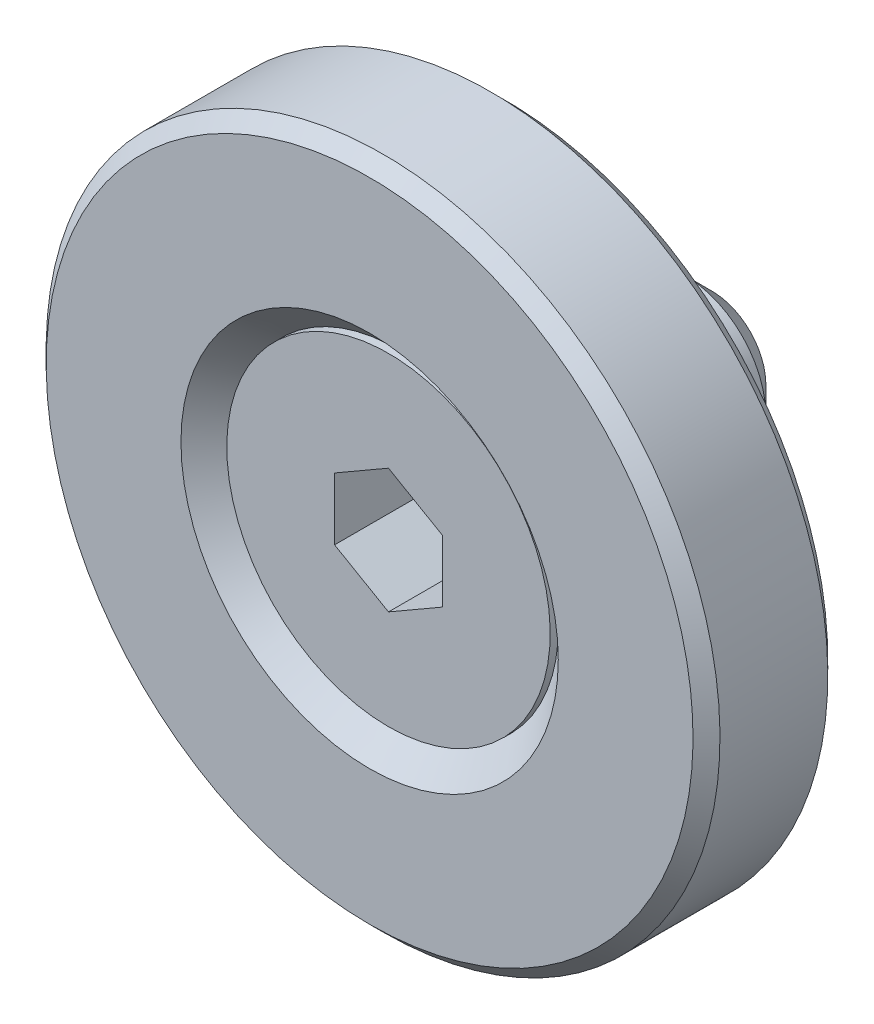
ISO-10303-21;
HEADER;
FILE_DESCRIPTION(('STEP AP214'),'2;1');
FILE_NAME('part.step','',(''),(''),'','','');
FILE_SCHEMA(('AUTOMOTIVE_DESIGN { 1 0 10303 214 1 1 1 1 }'));
ENDSEC;
DATA;
#1=APPLICATION_CONTEXT('core data for automotive mechanical design processes');
#2=APPLICATION_PROTOCOL_DEFINITION('international standard','automotive_design',2000,#1);
#3=PRODUCT_CONTEXT('',#1,'mechanical');
#4=PRODUCT('Part','Part','',(#3));
#5=PRODUCT_RELATED_PRODUCT_CATEGORY('part','',(#4));
#6=PRODUCT_DEFINITION_FORMATION('','',#4);
#7=PRODUCT_DEFINITION_CONTEXT('part definition',#1,'design');
#8=PRODUCT_DEFINITION('design','',#6,#7);
#9=PRODUCT_DEFINITION_SHAPE('','',#8);
#10=(LENGTH_UNIT() NAMED_UNIT(*) SI_UNIT(.MILLI.,.METRE.));
#11=(NAMED_UNIT(*) PLANE_ANGLE_UNIT() SI_UNIT($,.RADIAN.));
#12=(NAMED_UNIT(*) SI_UNIT($,.STERADIAN.) SOLID_ANGLE_UNIT());
#13=UNCERTAINTY_MEASURE_WITH_UNIT(LENGTH_MEASURE(1.E-05),#10,'distance_accuracy_value','');
#14=(GEOMETRIC_REPRESENTATION_CONTEXT(3) GLOBAL_UNCERTAINTY_ASSIGNED_CONTEXT((#13)) GLOBAL_UNIT_ASSIGNED_CONTEXT((#10,
#11,#12)) REPRESENTATION_CONTEXT('',''));
#15=CARTESIAN_POINT('',(0.,0.,0.));
#16=DIRECTION('',(0.,0.,1.));
#17=DIRECTION('',(1.,0.,0.));
#18=AXIS2_PLACEMENT_3D('',#15,#16,#17);
#19=CARTESIAN_POINT('',(0.,0.,10.));
#20=DIRECTION('',(0.,0.,1.));
#21=DIRECTION('',(0.,-1.,0.));
#22=AXIS2_PLACEMENT_3D('',#19,#20,#21);
#23=CYLINDRICAL_SURFACE('',#22,3.00000000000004);
#24=CARTESIAN_POINT('',(0.,0.,1.00000000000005));
#25=DIRECTION('',(0.,0.,1.));
#26=DIRECTION('',(0.,-1.,0.));
#27=AXIS2_PLACEMENT_3D('',#24,#25,#26);
#28=CIRCLE('',#27,3.);
#29=CARTESIAN_POINT('',(0.,-2.99999999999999,1.00000000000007));
#30=VERTEX_POINT('',#29);
#31=EDGE_CURVE('E115',#30,#30,#28,.T.);
#32=ORIENTED_EDGE('',*,*,#31,.F.);
#33=EDGE_LOOP('',(#32));
#34=FACE_BOUND('',#33,.T.);
#35=CARTESIAN_POINT('',(0.,0.,-6.7));
#36=DIRECTION('',(0.,0.,1.));
#37=DIRECTION('',(0.,-1.,0.));
#38=AXIS2_PLACEMENT_3D('',#35,#36,#37);
#39=CIRCLE('',#38,3.00000000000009);
#40=CARTESIAN_POINT('',(0.,-3.00000000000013,-6.69999999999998));
#41=VERTEX_POINT('',#40);
#42=EDGE_CURVE('E9',#41,#41,#39,.T.);
#43=ORIENTED_EDGE('',*,*,#42,.T.);
#44=EDGE_LOOP('',(#43));
#45=FACE_BOUND('',#44,.T.);
#46=ADVANCED_FACE('F14',(#34,#45),#23,.T.);
#47=CARTESIAN_POINT('',(0.,0.,-7.7));
#48=DIRECTION('',(0.,0.,1.));
#49=DIRECTION('',(0.,-1.,0.));
#50=AXIS2_PLACEMENT_3D('',#47,#48,#49);
#51=CONICAL_SURFACE('',#50,2.0000000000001,0.785398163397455);
#52=ORIENTED_EDGE('',*,*,#42,.F.);
#53=EDGE_LOOP('',(#52));
#54=FACE_BOUND('',#53,.T.);
#55=CARTESIAN_POINT('',(0.,0.,-7.7));
#56=DIRECTION('',(0.,0.,1.));
#57=DIRECTION('',(0.,-1.,0.));
#58=AXIS2_PLACEMENT_3D('',#55,#56,#57);
#59=CIRCLE('',#58,2.0000000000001);
#60=CARTESIAN_POINT('',(0.,-2.00000000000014,-7.69999999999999));
#61=VERTEX_POINT('',#60);
#62=EDGE_CURVE('E21',#61,#61,#59,.T.);
#63=ORIENTED_EDGE('',*,*,#62,.T.);
#64=EDGE_LOOP('',(#63));
#65=FACE_BOUND('',#64,.T.);
#66=ADVANCED_FACE('F155',(#54,#65),#51,.T.);
#67=CARTESIAN_POINT('',(0.,2.00000000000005,-7.7));
#68=DIRECTION('',(0.,0.,1.));
#69=DIRECTION('',(0.,-1.,0.));
#70=AXIS2_PLACEMENT_3D('',#67,#68,#69);
#71=PLANE('',#70);
#72=ORIENTED_EDGE('',*,*,#62,.F.);
#73=EDGE_LOOP('',(#72));
#74=FACE_BOUND('',#73,.T.);
#75=ADVANCED_FACE('F157',(#74),#71,.F.);
#76=CARTESIAN_POINT('',(0.,0.,4.30000000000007));
#77=DIRECTION('',(0.,0.,-1.));
#78=DIRECTION('',(0.,1.,0.));
#79=AXIS2_PLACEMENT_3D('',#76,#77,#78);
#80=PLANE('',#79);
#81=DIRECTION('',(-0.866025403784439,-0.5,0.));
#82=VECTOR('',#81,1.);
#83=CARTESIAN_POINT('',(0.,2.30940107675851,4.30000000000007));
#84=LINE('',#83,#82);
#85=CARTESIAN_POINT('',(0.,2.30940107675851,4.30000000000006));
#86=VERTEX_POINT('',#85);
#87=CARTESIAN_POINT('',(-2.,1.15470053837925,4.30000000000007));
#88=VERTEX_POINT('',#87);
#89=EDGE_CURVE('E102',#86,#88,#84,.T.);
#90=ORIENTED_EDGE('',*,*,#89,.F.);
#91=DIRECTION('',(-0.866025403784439,0.5,0.));
#92=VECTOR('',#91,1.);
#93=CARTESIAN_POINT('',(2.,1.15470053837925,4.30000000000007));
#94=LINE('',#93,#92);
#95=CARTESIAN_POINT('',(2.,1.15470053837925,4.30000000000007));
#96=VERTEX_POINT('',#95);
#97=EDGE_CURVE('E28',#96,#86,#94,.T.);
#98=ORIENTED_EDGE('',*,*,#97,.F.);
#99=DIRECTION('',(0.,1.,0.));
#100=VECTOR('',#99,1.);
#101=CARTESIAN_POINT('',(2.,-1.15470053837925,4.30000000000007));
#102=LINE('',#101,#100);
#103=CARTESIAN_POINT('',(2.,-1.15470053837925,4.30000000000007));
#104=VERTEX_POINT('',#103);
#105=EDGE_CURVE('E111',#104,#96,#102,.T.);
#106=ORIENTED_EDGE('',*,*,#105,.F.);
#107=DIRECTION('',(0.866025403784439,0.5,0.));
#108=VECTOR('',#107,1.);
#109=CARTESIAN_POINT('',(0.,-2.30940107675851,4.30000000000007));
#110=LINE('',#109,#108);
#111=CARTESIAN_POINT('',(0.,-2.30940107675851,4.30000000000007));
#112=VERTEX_POINT('',#111);
#113=EDGE_CURVE('E109',#112,#104,#110,.T.);
#114=ORIENTED_EDGE('',*,*,#113,.F.);
#115=DIRECTION('',(0.866025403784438,-0.5,0.));
#116=VECTOR('',#115,1.);
#117=CARTESIAN_POINT('',(-2.,-1.15470053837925,4.30000000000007));
#118=LINE('',#117,#116);
#119=CARTESIAN_POINT('',(-2.,-1.15470053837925,4.30000000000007));
#120=VERTEX_POINT('',#119);
#121=EDGE_CURVE('E76',#120,#112,#118,.T.);
#122=ORIENTED_EDGE('',*,*,#121,.F.);
#123=DIRECTION('',(0.,-1.,0.));
#124=VECTOR('',#123,1.);
#125=CARTESIAN_POINT('',(-2.,1.15470053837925,4.30000000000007));
#126=LINE('',#125,#124);
#127=EDGE_CURVE('E105',#88,#120,#126,.T.);
#128=ORIENTED_EDGE('',*,*,#127,.F.);
#129=EDGE_LOOP('',(#90,#98,#106,#114,#122,#128));
#130=FACE_BOUND('',#129,.T.);
#131=CARTESIAN_POINT('',(0.,0.,4.3000000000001));
#132=DIRECTION('',(0.,0.,1.));
#133=DIRECTION('',(0.,-1.,0.));
#134=AXIS2_PLACEMENT_3D('',#131,#132,#133);
#135=CIRCLE('',#134,6.);
#136=CARTESIAN_POINT('',(0.,-5.99999999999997,4.30000000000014));
#137=VERTEX_POINT('',#136);
#138=EDGE_CURVE('E150',#137,#137,#135,.T.);
#139=ORIENTED_EDGE('',*,*,#138,.T.);
#140=EDGE_LOOP('',(#139));
#141=FACE_BOUND('',#140,.T.);
#142=ADVANCED_FACE('F159',(#130,#141),#80,.F.);
#143=CARTESIAN_POINT('',(0.,0.,10.));
#144=DIRECTION('',(0.,0.,1.));
#145=DIRECTION('',(0.,-1.,0.));
#146=AXIS2_PLACEMENT_3D('',#143,#144,#145);
#147=CYLINDRICAL_SURFACE('',#146,6.);
#148=ORIENTED_EDGE('',*,*,#138,.F.);
#149=EDGE_LOOP('',(#148));
#150=FACE_BOUND('',#149,.T.);
#151=CARTESIAN_POINT('',(0.,0.,4.00000000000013));
#152=DIRECTION('',(0.,0.,1.));
#153=DIRECTION('',(0.,-1.,0.));
#154=AXIS2_PLACEMENT_3D('',#151,#152,#153);
#155=CIRCLE('',#154,6.);
#156=CARTESIAN_POINT('',(0.,-5.99999999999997,4.00000000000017));
#157=VERTEX_POINT('',#156);
#158=EDGE_CURVE('E147',#157,#157,#155,.T.);
#159=ORIENTED_EDGE('',*,*,#158,.T.);
#160=EDGE_LOOP('',(#159));
#161=FACE_BOUND('',#160,.T.);
#162=ADVANCED_FACE('F166',(#150,#161),#147,.T.);
#163=CARTESIAN_POINT('',(0.,0.,5.));
#164=DIRECTION('',(0.,0.,1.));
#165=DIRECTION('',(0.,-1.,0.));
#166=AXIS2_PLACEMENT_3D('',#163,#164,#165);
#167=CONICAL_SURFACE('',#166,7.,0.785398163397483);
#168=ORIENTED_EDGE('',*,*,#158,.F.);
#169=EDGE_LOOP('',(#168));
#170=FACE_BOUND('',#169,.T.);
#171=CARTESIAN_POINT('',(0.,0.,5.));
#172=DIRECTION('',(0.,0.,1.));
#173=DIRECTION('',(0.,-1.,0.));
#174=AXIS2_PLACEMENT_3D('',#171,#172,#173);
#175=CIRCLE('',#174,7.);
#176=CARTESIAN_POINT('',(0.,-6.99999999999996,5.00000000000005));
#177=VERTEX_POINT('',#176);
#178=EDGE_CURVE('E144',#177,#177,#175,.T.);
#179=ORIENTED_EDGE('',*,*,#178,.T.);
#180=EDGE_LOOP('',(#179));
#181=FACE_BOUND('',#180,.T.);
#182=ADVANCED_FACE('F218',(#170,#181),#167,.F.);
#183=CARTESIAN_POINT('',(0.,12.,5.));
#184=DIRECTION('',(0.,0.,-1.));
#185=DIRECTION('',(0.,1.,0.));
#186=AXIS2_PLACEMENT_3D('',#183,#184,#185);
#187=PLANE('',#186);
#188=ORIENTED_EDGE('',*,*,#178,.F.);
#189=EDGE_LOOP('',(#188));
#190=FACE_BOUND('',#189,.T.);
#191=CARTESIAN_POINT('',(0.,0.,5.00000000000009));
#192=DIRECTION('',(0.,0.,1.));
#193=DIRECTION('',(0.,-1.,0.));
#194=AXIS2_PLACEMENT_3D('',#191,#192,#193);
#195=CIRCLE('',#194,12.);
#196=CARTESIAN_POINT('',(0.,-12.,5.00000000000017));
#197=VERTEX_POINT('',#196);
#198=EDGE_CURVE('E141',#197,#197,#195,.T.);
#199=ORIENTED_EDGE('',*,*,#198,.T.);
#200=EDGE_LOOP('',(#199));
#201=FACE_BOUND('',#200,.T.);
#202=ADVANCED_FACE('F214',(#190,#201),#187,.F.);
#203=CARTESIAN_POINT('',(0.,0.,4.50000000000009));
#204=DIRECTION('',(0.,0.,-1.));
#205=DIRECTION('',(0.,1.,0.));
#206=AXIS2_PLACEMENT_3D('',#203,#204,#205);
#207=CONICAL_SURFACE('',#206,12.5,0.785398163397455);
#208=ORIENTED_EDGE('',*,*,#198,.F.);
#209=EDGE_LOOP('',(#208));
#210=FACE_BOUND('',#209,.T.);
#211=CARTESIAN_POINT('',(0.,0.,4.50000000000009));
#212=DIRECTION('',(0.,0.,1.));
#213=DIRECTION('',(0.,-1.,0.));
#214=AXIS2_PLACEMENT_3D('',#211,#212,#213);
#215=CIRCLE('',#214,12.5);
#216=CARTESIAN_POINT('',(0.,-12.5,4.50000000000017));
#217=VERTEX_POINT('',#216);
#218=EDGE_CURVE('E138',#217,#217,#215,.T.);
#219=ORIENTED_EDGE('',*,*,#218,.T.);
#220=EDGE_LOOP('',(#219));
#221=FACE_BOUND('',#220,.T.);
#222=ADVANCED_FACE('F210',(#210,#221),#207,.T.);
#223=CARTESIAN_POINT('',(0.,0.,10.));
#224=DIRECTION('',(0.,0.,1.));
#225=DIRECTION('',(0.,-1.,0.));
#226=AXIS2_PLACEMENT_3D('',#223,#224,#225);
#227=CYLINDRICAL_SURFACE('',#226,12.5);
#228=ORIENTED_EDGE('',*,*,#218,.F.);
#229=EDGE_LOOP('',(#228));
#230=FACE_BOUND('',#229,.T.);
#231=CARTESIAN_POINT('',(0.,0.,0.500000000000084));
#232=DIRECTION('',(0.,0.,1.));
#233=DIRECTION('',(0.,-1.,0.));
#234=AXIS2_PLACEMENT_3D('',#231,#232,#233);
#235=CIRCLE('',#234,12.5);
#236=CARTESIAN_POINT('',(0.,-12.5,0.500000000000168));
#237=VERTEX_POINT('',#236);
#238=EDGE_CURVE('E135',#237,#237,#235,.T.);
#239=ORIENTED_EDGE('',*,*,#238,.T.);
#240=EDGE_LOOP('',(#239));
#241=FACE_BOUND('',#240,.T.);
#242=ADVANCED_FACE('F206',(#230,#241),#227,.T.);
#243=CARTESIAN_POINT('',(0.,0.,0.));
#244=DIRECTION('',(0.,0.,1.));
#245=DIRECTION('',(0.,-1.,0.));
#246=AXIS2_PLACEMENT_3D('',#243,#244,#245);
#247=CONICAL_SURFACE('',#246,12.,0.785398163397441);
#248=ORIENTED_EDGE('',*,*,#238,.F.);
#249=EDGE_LOOP('',(#248));
#250=FACE_BOUND('',#249,.T.);
#251=CARTESIAN_POINT('',(0.,0.,0.));
#252=DIRECTION('',(0.,0.,1.));
#253=DIRECTION('',(0.,-1.,0.));
#254=AXIS2_PLACEMENT_3D('',#251,#252,#253);
#255=CIRCLE('',#254,12.);
#256=CARTESIAN_POINT('',(0.,-12.,1.60142367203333E-13));
#257=VERTEX_POINT('',#256);
#258=EDGE_CURVE('E132',#257,#257,#255,.T.);
#259=ORIENTED_EDGE('',*,*,#258,.T.);
#260=EDGE_LOOP('',(#259));
#261=FACE_BOUND('',#260,.T.);
#262=ADVANCED_FACE('F202',(#250,#261),#247,.T.);
#263=CARTESIAN_POINT('',(0.,3.40000000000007,0.));
#264=DIRECTION('',(0.,0.,1.));
#265=DIRECTION('',(0.,-1.,0.));
#266=AXIS2_PLACEMENT_3D('',#263,#264,#265);
#267=PLANE('',#266);
#268=ORIENTED_EDGE('',*,*,#258,.F.);
#269=EDGE_LOOP('',(#268));
#270=FACE_BOUND('',#269,.T.);
#271=CARTESIAN_POINT('',(0.,0.,0.));
#272=DIRECTION('',(0.,0.,1.));
#273=DIRECTION('',(0.,-1.,0.));
#274=AXIS2_PLACEMENT_3D('',#271,#272,#273);
#275=CIRCLE('',#274,3.40000000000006);
#276=CARTESIAN_POINT('',(0.,-3.40000000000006,0.));
#277=VERTEX_POINT('',#276);
#278=EDGE_CURVE('E129',#277,#277,#275,.T.);
#279=ORIENTED_EDGE('',*,*,#278,.T.);
#280=EDGE_LOOP('',(#279));
#281=FACE_BOUND('',#280,.T.);
#282=ADVANCED_FACE('F198',(#270,#281),#267,.F.);
#283=CARTESIAN_POINT('',(0.,0.,0.200000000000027));
#284=DIRECTION('',(0.,0.,-1.));
#285=DIRECTION('',(0.,1.,0.));
#286=AXIS2_PLACEMENT_3D('',#283,#284,#285);
#287=CONICAL_SURFACE('',#286,3.20000000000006,0.785398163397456);
#288=ORIENTED_EDGE('',*,*,#278,.F.);
#289=EDGE_LOOP('',(#288));
#290=FACE_BOUND('',#289,.T.);
#291=CARTESIAN_POINT('',(0.,0.,0.200000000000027));
#292=DIRECTION('',(0.,0.,1.));
#293=DIRECTION('',(0.,-1.,0.));
#294=AXIS2_PLACEMENT_3D('',#291,#292,#293);
#295=CIRCLE('',#294,3.20000000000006);
#296=CARTESIAN_POINT('',(0.,-3.20000000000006,0.200000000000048));
#297=VERTEX_POINT('',#296);
#298=EDGE_CURVE('E126',#297,#297,#295,.T.);
#299=ORIENTED_EDGE('',*,*,#298,.T.);
#300=EDGE_LOOP('',(#299));
#301=FACE_BOUND('',#300,.T.);
#302=ADVANCED_FACE('F190',(#290,#301),#287,.F.);
#303=CARTESIAN_POINT('',(0.,0.,10.));
#304=DIRECTION('',(0.,0.,1.));
#305=DIRECTION('',(0.,-1.,0.));
#306=AXIS2_PLACEMENT_3D('',#303,#304,#305);
#307=CYLINDRICAL_SURFACE('',#306,3.20000000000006);
#308=ORIENTED_EDGE('',*,*,#298,.F.);
#309=EDGE_LOOP('',(#308));
#310=FACE_BOUND('',#309,.T.);
#311=CARTESIAN_POINT('',(0.,0.,1.20000000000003));
#312=DIRECTION('',(0.,0.,1.));
#313=DIRECTION('',(0.,-1.,0.));
#314=AXIS2_PLACEMENT_3D('',#311,#312,#313);
#315=CIRCLE('',#314,3.20000000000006);
#316=CARTESIAN_POINT('',(0.,-3.20000000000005,1.20000000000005));
#317=VERTEX_POINT('',#316);
#318=EDGE_CURVE('E123',#317,#317,#315,.T.);
#319=ORIENTED_EDGE('',*,*,#318,.T.);
#320=EDGE_LOOP('',(#319));
#321=FACE_BOUND('',#320,.T.);
#322=ADVANCED_FACE('F181',(#310,#321),#307,.F.);
#323=CARTESIAN_POINT('',(0.,0.,1.00000000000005));
#324=DIRECTION('',(0.,0.,1.));
#325=DIRECTION('',(0.,-1.,0.));
#326=AXIS2_PLACEMENT_3D('',#323,#324,#325);
#327=CONICAL_SURFACE('',#326,3.,0.785398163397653);
#328=ORIENTED_EDGE('',*,*,#318,.F.);
#329=EDGE_LOOP('',(#328));
#330=FACE_BOUND('',#329,.T.);
#331=ORIENTED_EDGE('',*,*,#31,.T.);
#332=EDGE_LOOP('',(#331));
#333=FACE_BOUND('',#332,.T.);
#334=ADVANCED_FACE('F178',(#330,#333),#327,.T.);
#335=CARTESIAN_POINT('',(2.,1.15470053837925,1.30000000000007));
#336=DIRECTION('',(0.5,0.866025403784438,0.));
#337=DIRECTION('',(-0.866025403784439,0.5,0.));
#338=AXIS2_PLACEMENT_3D('',#335,#336,#337);
#339=PLANE('',#338);
#340=ORIENTED_EDGE('',*,*,#97,.T.);
#341=DIRECTION('',(0.,0.,1.));
#342=VECTOR('',#341,1.);
#343=CARTESIAN_POINT('',(0.,2.30940107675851,1.30000000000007));
#344=LINE('',#343,#342);
#345=CARTESIAN_POINT('',(0.,2.30940107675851,1.30000000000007));
#346=VERTEX_POINT('',#345);
#347=EDGE_CURVE('E58',#346,#86,#344,.T.);
#348=ORIENTED_EDGE('',*,*,#347,.F.);
#349=DIRECTION('',(-0.866025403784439,0.5,0.));
#350=VECTOR('',#349,1.);
#351=CARTESIAN_POINT('',(2.,1.15470053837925,1.30000000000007));
#352=LINE('',#351,#350);
#353=CARTESIAN_POINT('',(2.,1.15470053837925,1.30000000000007));
#354=VERTEX_POINT('',#353);
#355=EDGE_CURVE('E113',#354,#346,#352,.T.);
#356=ORIENTED_EDGE('',*,*,#355,.F.);
#357=DIRECTION('',(0.,0.,1.));
#358=VECTOR('',#357,1.);
#359=CARTESIAN_POINT('',(2.,1.15470053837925,1.30000000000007));
#360=LINE('',#359,#358);
#361=EDGE_CURVE('E36',#354,#96,#360,.T.);
#362=ORIENTED_EDGE('',*,*,#361,.T.);
#363=EDGE_LOOP('',(#340,#348,#356,#362));
#364=FACE_BOUND('',#363,.T.);
#365=ADVANCED_FACE('F180',(#364),#339,.F.);
#366=CARTESIAN_POINT('',(2.,-1.15470053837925,1.30000000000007));
#367=DIRECTION('',(1.,0.,0.));
#368=DIRECTION('',(0.,0.,-1.));
#369=AXIS2_PLACEMENT_3D('',#366,#367,#368);
#370=PLANE('',#369);
#371=ORIENTED_EDGE('',*,*,#105,.T.);
#372=ORIENTED_EDGE('',*,*,#361,.F.);
#373=DIRECTION('',(0.,1.,0.));
#374=VECTOR('',#373,1.);
#375=CARTESIAN_POINT('',(2.,-1.15470053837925,1.30000000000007));
#376=LINE('',#375,#374);
#377=CARTESIAN_POINT('',(2.,-1.15470053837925,1.30000000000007));
#378=VERTEX_POINT('',#377);
#379=EDGE_CURVE('E88',#378,#354,#376,.T.);
#380=ORIENTED_EDGE('',*,*,#379,.F.);
#381=DIRECTION('',(0.,0.,1.));
#382=VECTOR('',#381,1.);
#383=CARTESIAN_POINT('',(2.,-1.15470053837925,1.30000000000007));
#384=LINE('',#383,#382);
#385=EDGE_CURVE('E80',#378,#104,#384,.T.);
#386=ORIENTED_EDGE('',*,*,#385,.T.);
#387=EDGE_LOOP('',(#371,#372,#380,#386));
#388=FACE_BOUND('',#387,.T.);
#389=ADVANCED_FACE('F188',(#388),#370,.F.);
#390=CARTESIAN_POINT('',(0.,-2.30940107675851,1.30000000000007));
#391=DIRECTION('',(0.5,-0.866025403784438,0.));
#392=DIRECTION('',(0.866025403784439,0.5,0.));
#393=AXIS2_PLACEMENT_3D('',#390,#391,#392);
#394=PLANE('',#393);
#395=ORIENTED_EDGE('',*,*,#113,.T.);
#396=ORIENTED_EDGE('',*,*,#385,.F.);
#397=DIRECTION('',(0.866025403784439,0.5,0.));
#398=VECTOR('',#397,1.);
#399=CARTESIAN_POINT('',(0.,-2.30940107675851,1.30000000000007));
#400=LINE('',#399,#398);
#401=CARTESIAN_POINT('',(0.,-2.30940107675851,1.30000000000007));
#402=VERTEX_POINT('',#401);
#403=EDGE_CURVE('E84',#402,#378,#400,.T.);
#404=ORIENTED_EDGE('',*,*,#403,.F.);
#405=DIRECTION('',(0.,0.,1.));
#406=VECTOR('',#405,1.);
#407=CARTESIAN_POINT('',(0.,-2.30940107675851,1.30000000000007));
#408=LINE('',#407,#406);
#409=EDGE_CURVE('E69',#402,#112,#408,.T.);
#410=ORIENTED_EDGE('',*,*,#409,.T.);
#411=EDGE_LOOP('',(#395,#396,#404,#410));
#412=FACE_BOUND('',#411,.T.);
#413=ADVANCED_FACE('F85',(#412),#394,.F.);
#414=CARTESIAN_POINT('',(-2.,-1.15470053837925,1.30000000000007));
#415=DIRECTION('',(-0.5,-0.866025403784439,0.));
#416=DIRECTION('',(0.866025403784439,-0.5,0.));
#417=AXIS2_PLACEMENT_3D('',#414,#415,#416);
#418=PLANE('',#417);
#419=ORIENTED_EDGE('',*,*,#121,.T.);
#420=ORIENTED_EDGE('',*,*,#409,.F.);
#421=DIRECTION('',(0.866025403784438,-0.5,0.));
#422=VECTOR('',#421,1.);
#423=CARTESIAN_POINT('',(-2.,-1.15470053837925,1.30000000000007));
#424=LINE('',#423,#422);
#425=CARTESIAN_POINT('',(-2.,-1.15470053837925,1.30000000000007));
#426=VERTEX_POINT('',#425);
#427=EDGE_CURVE('E73',#426,#402,#424,.T.);
#428=ORIENTED_EDGE('',*,*,#427,.F.);
#429=DIRECTION('',(0.,0.,1.));
#430=VECTOR('',#429,1.);
#431=CARTESIAN_POINT('',(-2.,-1.15470053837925,1.30000000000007));
#432=LINE('',#431,#430);
#433=EDGE_CURVE('E81',#426,#120,#432,.T.);
#434=ORIENTED_EDGE('',*,*,#433,.T.);
#435=EDGE_LOOP('',(#419,#420,#428,#434));
#436=FACE_BOUND('',#435,.T.);
#437=ADVANCED_FACE('F71',(#436),#418,.F.);
#438=CARTESIAN_POINT('',(-2.,1.15470053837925,1.30000000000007));
#439=DIRECTION('',(-1.,0.,0.));
#440=DIRECTION('',(0.,0.,1.));
#441=AXIS2_PLACEMENT_3D('',#438,#439,#440);
#442=PLANE('',#441);
#443=ORIENTED_EDGE('',*,*,#127,.T.);
#444=ORIENTED_EDGE('',*,*,#433,.F.);
#445=DIRECTION('',(0.,-1.,0.));
#446=VECTOR('',#445,1.);
#447=CARTESIAN_POINT('',(-2.,1.15470053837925,1.30000000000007));
#448=LINE('',#447,#446);
#449=CARTESIAN_POINT('',(-2.,1.15470053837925,1.30000000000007));
#450=VERTEX_POINT('',#449);
#451=EDGE_CURVE('E94',#450,#426,#448,.T.);
#452=ORIENTED_EDGE('',*,*,#451,.F.);
#453=DIRECTION('',(0.,0.,1.));
#454=VECTOR('',#453,1.);
#455=CARTESIAN_POINT('',(-2.,1.15470053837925,1.30000000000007));
#456=LINE('',#455,#454);
#457=EDGE_CURVE('E118',#450,#88,#456,.T.);
#458=ORIENTED_EDGE('',*,*,#457,.T.);
#459=EDGE_LOOP('',(#443,#444,#452,#458));
#460=FACE_BOUND('',#459,.T.);
#461=ADVANCED_FACE('F330',(#460),#442,.F.);
#462=CARTESIAN_POINT('',(0.,2.30940107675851,1.30000000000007));
#463=DIRECTION('',(-0.5,0.866025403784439,0.));
#464=DIRECTION('',(-0.866025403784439,-0.5,0.));
#465=AXIS2_PLACEMENT_3D('',#462,#463,#464);
#466=PLANE('',#465);
#467=ORIENTED_EDGE('',*,*,#89,.T.);
#468=ORIENTED_EDGE('',*,*,#457,.F.);
#469=DIRECTION('',(-0.866025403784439,-0.5,0.));
#470=VECTOR('',#469,1.);
#471=CARTESIAN_POINT('',(0.,2.30940107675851,1.30000000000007));
#472=LINE('',#471,#470);
#473=EDGE_CURVE('E96',#346,#450,#472,.T.);
#474=ORIENTED_EDGE('',*,*,#473,.F.);
#475=ORIENTED_EDGE('',*,*,#347,.T.);
#476=EDGE_LOOP('',(#467,#468,#474,#475));
#477=FACE_BOUND('',#476,.T.);
#478=ADVANCED_FACE('F339',(#477),#466,.F.);
#479=CARTESIAN_POINT('',(0.,2.30940107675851,1.30000000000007));
#480=DIRECTION('',(0.,0.,1.));
#481=DIRECTION('',(1.,0.,0.));
#482=AXIS2_PLACEMENT_3D('',#479,#480,#481);
#483=PLANE('',#482);
#484=ORIENTED_EDGE('',*,*,#355,.T.);
#485=ORIENTED_EDGE('',*,*,#473,.T.);
#486=ORIENTED_EDGE('',*,*,#451,.T.);
#487=ORIENTED_EDGE('',*,*,#427,.T.);
#488=ORIENTED_EDGE('',*,*,#403,.T.);
#489=ORIENTED_EDGE('',*,*,#379,.T.);
#490=EDGE_LOOP('',(#484,#485,#486,#487,#488,#489));
#491=FACE_BOUND('',#490,.T.);
#492=ADVANCED_FACE('F91',(#491),#483,.T.);
#493=CLOSED_SHELL('',(#46,#66,#75,#142,#162,#182,#202,#222,#242,#262,#282,#302,#322,#334,#365,
#389,#413,#437,#461,#478,#492));
#494=MANIFOLD_SOLID_BREP('B1',#493);
#495=ADVANCED_BREP_SHAPE_REPRESENTATION('',(#18,#494),#14);
#496=SHAPE_DEFINITION_REPRESENTATION(#9,#495);
ENDSEC;
END-ISO-10303-21;
